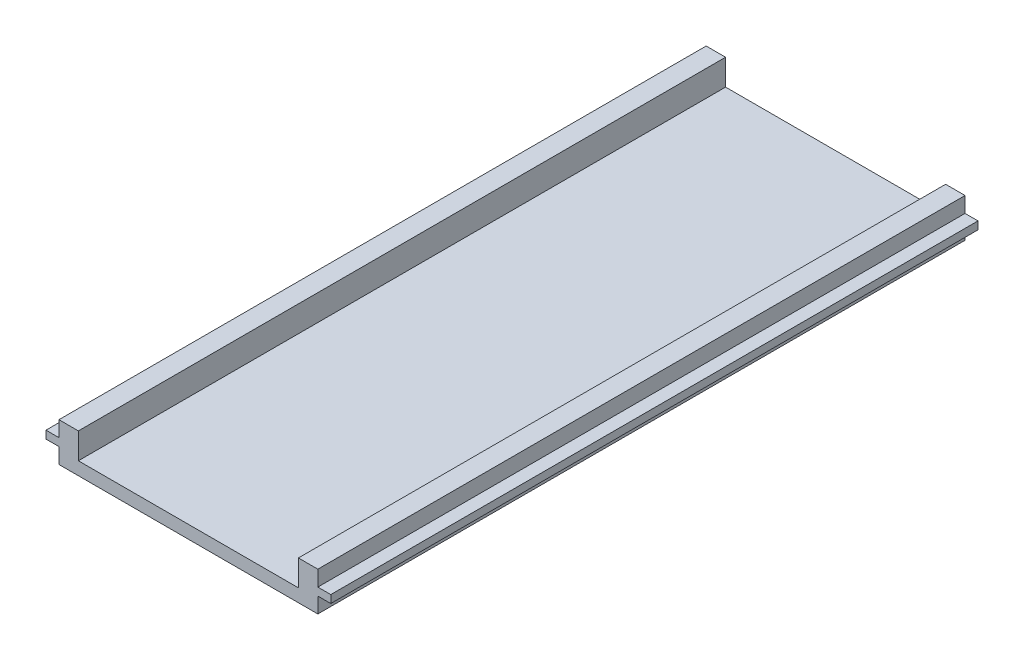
from build123d import *

# Parameters (mm, degrees)
BOSS_EXTRU_1_DEPTH = 50


with BuildPart() as part:
    # Esquisse1 → Boss.-Extru.1 (new body)
    with BuildSketch(Plane.XY):
        Polygon((4.731961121, 0), (24.731961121, 0), (24.731961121, 1.2), (25.731961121, 1.2), (25.731961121, 1.8), (24.731961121, 1.8), (24.731961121, 3), (23.231961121, 3), (23.231961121, 1), (6.231961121, 1), (6.231961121, 3), (4.731961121, 3), (4.731961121, 1.8), (3.731961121, 1.8), (3.731961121, 1.2), (4.731961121, 1.2), align=None)
    extrude(amount=BOSS_EXTRU_1_DEPTH)


solid = part.part
